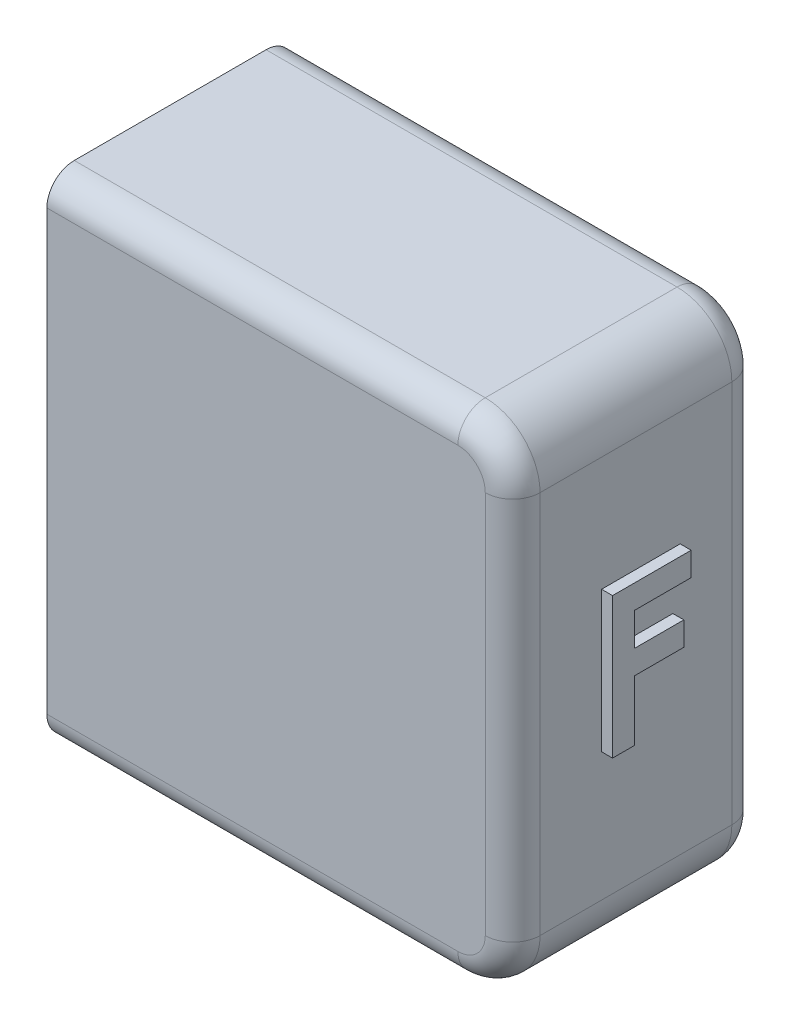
ISO-10303-21;
HEADER;
FILE_DESCRIPTION(('STEP AP214'),'2;1');
FILE_NAME('part.step','',(''),(''),'','','');
FILE_SCHEMA(('AUTOMOTIVE_DESIGN { 1 0 10303 214 1 1 1 1 }'));
ENDSEC;
DATA;
#1=APPLICATION_CONTEXT('core data for automotive mechanical design processes');
#2=APPLICATION_PROTOCOL_DEFINITION('international standard','automotive_design',2000,#1);
#3=PRODUCT_CONTEXT('',#1,'mechanical');
#4=PRODUCT('Part','Part','',(#3));
#5=PRODUCT_RELATED_PRODUCT_CATEGORY('part','',(#4));
#6=PRODUCT_DEFINITION_FORMATION('','',#4);
#7=PRODUCT_DEFINITION_CONTEXT('part definition',#1,'design');
#8=PRODUCT_DEFINITION('design','',#6,#7);
#9=PRODUCT_DEFINITION_SHAPE('','',#8);
#10=(LENGTH_UNIT() NAMED_UNIT(*) SI_UNIT(.MILLI.,.METRE.));
#11=(NAMED_UNIT(*) PLANE_ANGLE_UNIT() SI_UNIT($,.RADIAN.));
#12=(NAMED_UNIT(*) SI_UNIT($,.STERADIAN.) SOLID_ANGLE_UNIT());
#13=UNCERTAINTY_MEASURE_WITH_UNIT(LENGTH_MEASURE(1.E-05),#10,'distance_accuracy_value','');
#14=(GEOMETRIC_REPRESENTATION_CONTEXT(3) GLOBAL_UNCERTAINTY_ASSIGNED_CONTEXT((#13)) GLOBAL_UNIT_ASSIGNED_CONTEXT((#10,
#11,#12)) REPRESENTATION_CONTEXT('',''));
#15=CARTESIAN_POINT('',(0.,0.,0.));
#16=DIRECTION('',(0.,0.,1.));
#17=DIRECTION('',(1.,0.,0.));
#18=AXIS2_PLACEMENT_3D('',#15,#16,#17);
#19=CARTESIAN_POINT('',(5.5,-7.,7.));
#20=DIRECTION('',(1.,0.,0.));
#21=DIRECTION('',(0.,1.,0.));
#22=AXIS2_PLACEMENT_3D('',#19,#20,#21);
#23=PLANE('',#22);
#24=DIRECTION('',(0.,1.,0.));
#25=VECTOR('',#24,1.);
#26=CARTESIAN_POINT('',(5.49999999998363,6.19999999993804,3.5));
#27=LINE('',#26,#25);
#28=CARTESIAN_POINT('',(5.5,6.2,3.5));
#29=VERTEX_POINT('',#28);
#30=CARTESIAN_POINT('',(5.5,7.,3.5));
#31=VERTEX_POINT('',#30);
#32=EDGE_CURVE('E390',#29,#31,#27,.T.);
#33=ORIENTED_EDGE('',*,*,#32,.T.);
#34=DIRECTION('',(0.,0.,-1.));
#35=VECTOR('',#34,1.);
#36=CARTESIAN_POINT('',(5.5,7.,7.));
#37=LINE('',#36,#35);
#38=CARTESIAN_POINT('',(5.5,7.,2.));
#39=VERTEX_POINT('',#38);
#40=EDGE_CURVE('E484',#31,#39,#37,.T.);
#41=ORIENTED_EDGE('',*,*,#40,.T.);
#42=DIRECTION('',(0.,-1.,0.));
#43=VECTOR('',#42,1.);
#44=CARTESIAN_POINT('',(5.5,-7.,2.));
#45=LINE('',#44,#43);
#46=CARTESIAN_POINT('',(5.5,-7.,2.));
#47=VERTEX_POINT('',#46);
#48=EDGE_CURVE('E459',#39,#47,#45,.T.);
#49=ORIENTED_EDGE('',*,*,#48,.T.);
#50=DIRECTION('',(0.,0.,-1.));
#51=VECTOR('',#50,1.);
#52=CARTESIAN_POINT('',(5.5,-7.,7.));
#53=LINE('',#52,#51);
#54=CARTESIAN_POINT('',(5.49999999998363,-7.,3.5));
#55=VERTEX_POINT('',#54);
#56=EDGE_CURVE('E480',#55,#47,#53,.T.);
#57=ORIENTED_EDGE('',*,*,#56,.F.);
#58=DIRECTION('',(0.,1.,0.));
#59=VECTOR('',#58,1.);
#60=CARTESIAN_POINT('',(5.49999999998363,-6.20000000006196,3.5));
#61=LINE('',#60,#59);
#62=CARTESIAN_POINT('',(5.49999999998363,-6.2,3.5));
#63=VERTEX_POINT('',#62);
#64=EDGE_CURVE('E418',#55,#63,#61,.T.);
#65=ORIENTED_EDGE('',*,*,#64,.T.);
#66=DIRECTION('',(0.,0.,1.));
#67=VECTOR('',#66,1.);
#68=CARTESIAN_POINT('',(5.49999999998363,-6.2,3.5));
#69=LINE('',#68,#67);
#70=CARTESIAN_POINT('',(5.49999999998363,-6.2,5.5));
#71=VERTEX_POINT('',#70);
#72=EDGE_CURVE('E423',#63,#71,#69,.T.);
#73=ORIENTED_EDGE('',*,*,#72,.T.);
#74=DIRECTION('',(0.,-1.,0.));
#75=VECTOR('',#74,1.);
#76=CARTESIAN_POINT('',(5.49999999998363,-6.20000000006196,5.5));
#77=LINE('',#76,#75);
#78=CARTESIAN_POINT('',(5.49999999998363,-7.,5.5));
#79=VERTEX_POINT('',#78);
#80=EDGE_CURVE('E419',#71,#79,#77,.T.);
#81=ORIENTED_EDGE('',*,*,#80,.T.);
#82=CARTESIAN_POINT('',(5.5,-7.,7.));
#83=VERTEX_POINT('',#82);
#84=EDGE_CURVE('E481',#83,#79,#53,.T.);
#85=ORIENTED_EDGE('',*,*,#84,.F.);
#86=DIRECTION('',(0.,-1.,0.));
#87=VECTOR('',#86,1.);
#88=CARTESIAN_POINT('',(5.5,-7.,7.));
#89=LINE('',#88,#87);
#90=CARTESIAN_POINT('',(5.5,7.,7.));
#91=VERTEX_POINT('',#90);
#92=EDGE_CURVE('E438',#91,#83,#89,.T.);
#93=ORIENTED_EDGE('',*,*,#92,.F.);
#94=CARTESIAN_POINT('',(5.5,7.,5.5));
#95=VERTEX_POINT('',#94);
#96=EDGE_CURVE('E485',#91,#95,#37,.T.);
#97=ORIENTED_EDGE('',*,*,#96,.T.);
#98=DIRECTION('',(0.,-1.,0.));
#99=VECTOR('',#98,1.);
#100=CARTESIAN_POINT('',(5.49999999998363,6.19999999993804,5.5));
#101=LINE('',#100,#99);
#102=CARTESIAN_POINT('',(5.5,6.2,5.5));
#103=VERTEX_POINT('',#102);
#104=EDGE_CURVE('E402',#95,#103,#101,.T.);
#105=ORIENTED_EDGE('',*,*,#104,.T.);
#106=DIRECTION('',(0.,0.,-1.));
#107=VECTOR('',#106,1.);
#108=CARTESIAN_POINT('',(5.49999999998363,6.2,3.5));
#109=LINE('',#108,#107);
#110=EDGE_CURVE('E399',#103,#29,#109,.T.);
#111=ORIENTED_EDGE('',*,*,#110,.T.);
#112=EDGE_LOOP('',(#33,#41,#49,#57,#65,#73,#81,#85,#93,#97,#105,#111));
#113=FACE_BOUND('',#112,.T.);
#114=ADVANCED_FACE('F37',(#113),#23,.F.);
#115=CARTESIAN_POINT('',(-5.5,7.,7.));
#116=DIRECTION('',(-1.,0.,0.));
#117=DIRECTION('',(0.,0.,1.));
#118=AXIS2_PLACEMENT_3D('',#115,#116,#117);
#119=PLANE('',#118);
#120=DIRECTION('',(0.,1.,0.));
#121=VECTOR('',#120,1.);
#122=CARTESIAN_POINT('',(-5.5,6.2,3.5));
#123=LINE('',#122,#121);
#124=CARTESIAN_POINT('',(-5.5,6.2,3.5));
#125=VERTEX_POINT('',#124);
#126=CARTESIAN_POINT('',(-5.5,7.,3.5));
#127=VERTEX_POINT('',#126);
#128=EDGE_CURVE('E377',#125,#127,#123,.T.);
#129=ORIENTED_EDGE('',*,*,#128,.F.);
#130=DIRECTION('',(0.,0.,-1.));
#131=VECTOR('',#130,1.);
#132=CARTESIAN_POINT('',(-5.5,6.2,7.));
#133=LINE('',#132,#131);
#134=CARTESIAN_POINT('',(-5.5,6.2,2.));
#135=VERTEX_POINT('',#134);
#136=EDGE_CURVE('E491',#125,#135,#133,.T.);
#137=ORIENTED_EDGE('',*,*,#136,.T.);
#138=DIRECTION('',(0.,1.,0.));
#139=VECTOR('',#138,1.);
#140=CARTESIAN_POINT('',(-5.5,7.,2.));
#141=LINE('',#140,#139);
#142=CARTESIAN_POINT('',(-5.5,7.,2.));
#143=VERTEX_POINT('',#142);
#144=EDGE_CURVE('E453',#135,#143,#141,.T.);
#145=ORIENTED_EDGE('',*,*,#144,.T.);
#146=DIRECTION('',(0.,0.,-1.));
#147=VECTOR('',#146,1.);
#148=CARTESIAN_POINT('',(-5.5,7.,7.));
#149=LINE('',#148,#147);
#150=EDGE_CURVE('E488',#127,#143,#149,.T.);
#151=ORIENTED_EDGE('',*,*,#150,.F.);
#152=EDGE_LOOP('',(#129,#137,#145,#151));
#153=FACE_BOUND('',#152,.T.);
#154=ADVANCED_FACE('F667',(#153),#119,.F.);
#155=DIRECTION('',(0.,-1.,0.));
#156=VECTOR('',#155,1.);
#157=CARTESIAN_POINT('',(-5.5,6.2,5.5));
#158=LINE('',#157,#156);
#159=CARTESIAN_POINT('',(-5.5,7.,5.5));
#160=VERTEX_POINT('',#159);
#161=CARTESIAN_POINT('',(-5.5,6.2,5.5));
#162=VERTEX_POINT('',#161);
#163=EDGE_CURVE('E384',#160,#162,#158,.T.);
#164=ORIENTED_EDGE('',*,*,#163,.F.);
#165=CARTESIAN_POINT('',(-5.5,7.,7.));
#166=VERTEX_POINT('',#165);
#167=EDGE_CURVE('E489',#166,#160,#149,.T.);
#168=ORIENTED_EDGE('',*,*,#167,.F.);
#169=DIRECTION('',(0.,1.,0.));
#170=VECTOR('',#169,1.);
#171=CARTESIAN_POINT('',(-5.5,7.,7.));
#172=LINE('',#171,#170);
#173=CARTESIAN_POINT('',(-5.5,6.2,7.));
#174=VERTEX_POINT('',#173);
#175=EDGE_CURVE('E431',#174,#166,#172,.T.);
#176=ORIENTED_EDGE('',*,*,#175,.F.);
#177=EDGE_CURVE('E492',#174,#162,#133,.T.);
#178=ORIENTED_EDGE('',*,*,#177,.T.);
#179=EDGE_LOOP('',(#164,#168,#176,#178));
#180=FACE_BOUND('',#179,.T.);
#181=ADVANCED_FACE('F673',(#180),#119,.F.);
#182=CARTESIAN_POINT('',(5.5,7.,7.));
#183=DIRECTION('',(0.,1.,0.));
#184=DIRECTION('',(-1.,0.,0.));
#185=AXIS2_PLACEMENT_3D('',#182,#183,#184);
#186=PLANE('',#185);
#187=DIRECTION('',(-1.,0.,0.));
#188=VECTOR('',#187,1.);
#189=CARTESIAN_POINT('',(500000.,7.,3.5));
#190=LINE('',#189,#188);
#191=EDGE_CURVE('E388',#31,#127,#190,.T.);
#192=ORIENTED_EDGE('',*,*,#191,.T.);
#193=ORIENTED_EDGE('',*,*,#150,.T.);
#194=DIRECTION('',(1.,0.,0.));
#195=VECTOR('',#194,1.);
#196=CARTESIAN_POINT('',(5.5,7.,2.));
#197=LINE('',#196,#195);
#198=EDGE_CURVE('E456',#143,#39,#197,.T.);
#199=ORIENTED_EDGE('',*,*,#198,.T.);
#200=ORIENTED_EDGE('',*,*,#40,.F.);
#201=EDGE_LOOP('',(#192,#193,#199,#200));
#202=FACE_BOUND('',#201,.T.);
#203=ADVANCED_FACE('F680',(#202),#186,.F.);
#204=DIRECTION('',(-1.,0.,0.));
#205=VECTOR('',#204,1.);
#206=CARTESIAN_POINT('',(500000.,7.,5.5));
#207=LINE('',#206,#205);
#208=EDGE_CURVE('E391',#95,#160,#207,.T.);
#209=ORIENTED_EDGE('',*,*,#208,.F.);
#210=ORIENTED_EDGE('',*,*,#96,.F.);
#211=DIRECTION('',(1.,0.,0.));
#212=VECTOR('',#211,1.);
#213=CARTESIAN_POINT('',(5.5,7.,7.));
#214=LINE('',#213,#212);
#215=EDGE_CURVE('E435',#166,#91,#214,.T.);
#216=ORIENTED_EDGE('',*,*,#215,.F.);
#217=ORIENTED_EDGE('',*,*,#167,.T.);
#218=EDGE_LOOP('',(#209,#210,#216,#217));
#219=FACE_BOUND('',#218,.T.);
#220=ADVANCED_FACE('F682',(#219),#186,.F.);
#221=CARTESIAN_POINT('',(-5.5,-7.,7.));
#222=DIRECTION('',(0.,-1.,0.));
#223=DIRECTION('',(1.,0.,0.));
#224=AXIS2_PLACEMENT_3D('',#221,#222,#223);
#225=PLANE('',#224);
#226=DIRECTION('',(-1.,0.,0.));
#227=VECTOR('',#226,1.);
#228=CARTESIAN_POINT('',(500000.,-7.,5.5));
#229=LINE('',#228,#227);
#230=CARTESIAN_POINT('',(-5.5,-7.,5.5));
#231=VERTEX_POINT('',#230);
#232=EDGE_CURVE('E410',#79,#231,#229,.T.);
#233=ORIENTED_EDGE('',*,*,#232,.T.);
#234=DIRECTION('',(0.,0.,-1.));
#235=VECTOR('',#234,1.);
#236=CARTESIAN_POINT('',(-5.5,-7.,7.));
#237=LINE('',#236,#235);
#238=CARTESIAN_POINT('',(-5.5,-7.,7.));
#239=VERTEX_POINT('',#238);
#240=EDGE_CURVE('E477',#239,#231,#237,.T.);
#241=ORIENTED_EDGE('',*,*,#240,.F.);
#242=DIRECTION('',(-1.,0.,0.));
#243=VECTOR('',#242,1.);
#244=CARTESIAN_POINT('',(-5.5,-7.,7.));
#245=LINE('',#244,#243);
#246=EDGE_CURVE('E441',#83,#239,#245,.T.);
#247=ORIENTED_EDGE('',*,*,#246,.F.);
#248=ORIENTED_EDGE('',*,*,#84,.T.);
#249=EDGE_LOOP('',(#233,#241,#247,#248));
#250=FACE_BOUND('',#249,.T.);
#251=ADVANCED_FACE('F678',(#250),#225,.F.);
#252=DIRECTION('',(-1.,0.,0.));
#253=VECTOR('',#252,1.);
#254=CARTESIAN_POINT('',(500000.,-7.,3.5));
#255=LINE('',#254,#253);
#256=CARTESIAN_POINT('',(-5.5,-7.,3.5));
#257=VERTEX_POINT('',#256);
#258=EDGE_CURVE('E407',#55,#257,#255,.T.);
#259=ORIENTED_EDGE('',*,*,#258,.F.);
#260=ORIENTED_EDGE('',*,*,#56,.T.);
#261=DIRECTION('',(-1.,0.,0.));
#262=VECTOR('',#261,1.);
#263=CARTESIAN_POINT('',(-5.5,-7.,2.));
#264=LINE('',#263,#262);
#265=CARTESIAN_POINT('',(-5.5,-7.,2.));
#266=VERTEX_POINT('',#265);
#267=EDGE_CURVE('E462',#47,#266,#264,.T.);
#268=ORIENTED_EDGE('',*,*,#267,.T.);
#269=EDGE_CURVE('E476',#257,#266,#237,.T.);
#270=ORIENTED_EDGE('',*,*,#269,.F.);
#271=EDGE_LOOP('',(#259,#260,#268,#270));
#272=FACE_BOUND('',#271,.T.);
#273=ADVANCED_FACE('F707',(#272),#225,.F.);
#274=CARTESIAN_POINT('',(-5.5,-6.2,7.));
#275=DIRECTION('',(-1.,0.,0.));
#276=DIRECTION('',(0.,0.,1.));
#277=AXIS2_PLACEMENT_3D('',#274,#275,#276);
#278=PLANE('',#277);
#279=DIRECTION('',(0.,-1.,0.));
#280=VECTOR('',#279,1.);
#281=CARTESIAN_POINT('',(-5.5,-6.2,5.5));
#282=LINE('',#281,#280);
#283=CARTESIAN_POINT('',(-5.5,-6.2,5.5));
#284=VERTEX_POINT('',#283);
#285=EDGE_CURVE('E405',#284,#231,#282,.T.);
#286=ORIENTED_EDGE('',*,*,#285,.F.);
#287=DIRECTION('',(0.,0.,-1.));
#288=VECTOR('',#287,1.);
#289=CARTESIAN_POINT('',(-5.5,-6.2,7.));
#290=LINE('',#289,#288);
#291=CARTESIAN_POINT('',(-5.5,-6.2,7.));
#292=VERTEX_POINT('',#291);
#293=EDGE_CURVE('E473',#292,#284,#290,.T.);
#294=ORIENTED_EDGE('',*,*,#293,.F.);
#295=DIRECTION('',(0.,1.,0.));
#296=VECTOR('',#295,1.);
#297=CARTESIAN_POINT('',(-5.5,-6.2,7.));
#298=LINE('',#297,#296);
#299=EDGE_CURVE('E444',#239,#292,#298,.T.);
#300=ORIENTED_EDGE('',*,*,#299,.F.);
#301=ORIENTED_EDGE('',*,*,#240,.T.);
#302=EDGE_LOOP('',(#286,#294,#300,#301));
#303=FACE_BOUND('',#302,.T.);
#304=ADVANCED_FACE('F695',(#303),#278,.F.);
#305=DIRECTION('',(0.,1.,0.));
#306=VECTOR('',#305,1.);
#307=CARTESIAN_POINT('',(-5.5,-6.2,3.5));
#308=LINE('',#307,#306);
#309=CARTESIAN_POINT('',(-5.5,-6.2,3.5));
#310=VERTEX_POINT('',#309);
#311=EDGE_CURVE('E401',#257,#310,#308,.T.);
#312=ORIENTED_EDGE('',*,*,#311,.F.);
#313=ORIENTED_EDGE('',*,*,#269,.T.);
#314=DIRECTION('',(0.,1.,0.));
#315=VECTOR('',#314,1.);
#316=CARTESIAN_POINT('',(-5.5,-6.2,2.));
#317=LINE('',#316,#315);
#318=CARTESIAN_POINT('',(-5.5,-6.2,2.));
#319=VERTEX_POINT('',#318);
#320=EDGE_CURVE('E465',#266,#319,#317,.T.);
#321=ORIENTED_EDGE('',*,*,#320,.T.);
#322=EDGE_CURVE('E472',#310,#319,#290,.T.);
#323=ORIENTED_EDGE('',*,*,#322,.F.);
#324=EDGE_LOOP('',(#312,#313,#321,#323));
#325=FACE_BOUND('',#324,.T.);
#326=ADVANCED_FACE('F686',(#325),#278,.F.);
#327=CARTESIAN_POINT('',(0.,0.,2.));
#328=DIRECTION('',(0.,0.,-1.));
#329=DIRECTION('',(-1.,0.,0.));
#330=AXIS2_PLACEMENT_3D('',#327,#328,#329);
#331=PLANE('',#330);
#332=DIRECTION('',(-1.,0.,0.));
#333=VECTOR('',#332,1.);
#334=CARTESIAN_POINT('',(-5.5,-6.2,2.));
#335=LINE('',#334,#333);
#336=CARTESIAN_POINT('',(-8.5,-6.2,2.));
#337=VERTEX_POINT('',#336);
#338=EDGE_CURVE('E432',#319,#337,#335,.T.);
#339=ORIENTED_EDGE('',*,*,#338,.F.);
#340=ORIENTED_EDGE('',*,*,#320,.F.);
#341=ORIENTED_EDGE('',*,*,#267,.F.);
#342=ORIENTED_EDGE('',*,*,#48,.F.);
#343=ORIENTED_EDGE('',*,*,#198,.F.);
#344=ORIENTED_EDGE('',*,*,#144,.F.);
#345=DIRECTION('',(1.,0.,0.));
#346=VECTOR('',#345,1.);
#347=CARTESIAN_POINT('',(-5.5,6.2,2.));
#348=LINE('',#347,#346);
#349=CARTESIAN_POINT('',(-8.5,6.2,2.));
#350=VERTEX_POINT('',#349);
#351=EDGE_CURVE('E422',#350,#135,#348,.T.);
#352=ORIENTED_EDGE('',*,*,#351,.F.);
#353=DIRECTION('',(0.,-1.,0.));
#354=VECTOR('',#353,1.);
#355=CARTESIAN_POINT('',(-8.5,-9.,2.));
#356=LINE('',#355,#354);
#357=EDGE_CURVE('E498',#350,#337,#356,.T.);
#358=ORIENTED_EDGE('',*,*,#357,.T.);
#359=EDGE_LOOP('',(#339,#340,#341,#342,#343,#344,#352,#358));
#360=FACE_BOUND('',#359,.T.);
#361=ADVANCED_FACE('F684',(#360),#331,.F.);
#362=CARTESIAN_POINT('',(8.5,-9.,2.));
#363=DIRECTION('',(-1.,0.,0.));
#364=DIRECTION('',(0.,0.,1.));
#365=AXIS2_PLACEMENT_3D('',#362,#363,#364);
#366=PLANE('',#365);
#367=DIRECTION('',(0.,-1.,0.));
#368=VECTOR('',#367,1.);
#369=CARTESIAN_POINT('',(8.5,-0.111573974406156,4.95365833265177));
#370=LINE('',#369,#368);
#371=CARTESIAN_POINT('',(8.5,-0.111573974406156,4.95365833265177));
#372=VERTEX_POINT('',#371);
#373=CARTESIAN_POINT('',(8.5,-2.31298999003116,4.95365833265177));
#374=VERTEX_POINT('',#373);
#375=EDGE_CURVE('E311',#372,#374,#370,.T.);
#376=ORIENTED_EDGE('',*,*,#375,.T.);
#377=DIRECTION('',(0.,0.,1.));
#378=VECTOR('',#377,1.);
#379=CARTESIAN_POINT('',(8.5,-2.31298999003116,4.95365833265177));
#380=LINE('',#379,#378);
#381=CARTESIAN_POINT('',(8.5,-2.31298999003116,5.7541732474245));
#382=VERTEX_POINT('',#381);
#383=EDGE_CURVE('E337',#374,#382,#380,.T.);
#384=ORIENTED_EDGE('',*,*,#383,.T.);
#385=DIRECTION('',(0.,1.,0.));
#386=VECTOR('',#385,1.);
#387=CARTESIAN_POINT('',(8.5,-2.31298999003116,5.7541732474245));
#388=LINE('',#387,#386);
#389=CARTESIAN_POINT('',(8.5,2.82364737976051,5.7541732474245));
#390=VERTEX_POINT('',#389);
#391=EDGE_CURVE('E290',#382,#390,#388,.T.);
#392=ORIENTED_EDGE('',*,*,#391,.T.);
#393=DIRECTION('',(0.,0.,-1.));
#394=VECTOR('',#393,1.);
#395=CARTESIAN_POINT('',(8.5,2.82364737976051,5.7541732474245));
#396=LINE('',#395,#394);
#397=CARTESIAN_POINT('',(8.5,2.82364737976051,2.8856614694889));
#398=VERTEX_POINT('',#397);
#399=EDGE_CURVE('E54',#390,#398,#396,.T.);
#400=ORIENTED_EDGE('',*,*,#399,.T.);
#401=DIRECTION('',(0.,-1.,0.));
#402=VECTOR('',#401,1.);
#403=CARTESIAN_POINT('',(8.5,2.82364737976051,2.8856614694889));
#404=LINE('',#403,#402);
#405=CARTESIAN_POINT('',(8.5,1.95642288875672,2.8856614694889));
#406=VERTEX_POINT('',#405);
#407=EDGE_CURVE('E341',#398,#406,#404,.T.);
#408=ORIENTED_EDGE('',*,*,#407,.T.);
#409=DIRECTION('',(0.,0.,1.));
#410=VECTOR('',#409,1.);
#411=CARTESIAN_POINT('',(8.5,1.95642288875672,2.8856614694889));
#412=LINE('',#411,#410);
#413=CARTESIAN_POINT('',(8.5,1.95642288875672,4.95365833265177));
#414=VERTEX_POINT('',#413);
#415=EDGE_CURVE('E344',#406,#414,#412,.T.);
#416=ORIENTED_EDGE('',*,*,#415,.T.);
#417=DIRECTION('',(0.,-1.,0.));
#418=VECTOR('',#417,1.);
#419=CARTESIAN_POINT('',(8.5,1.95642288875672,4.95365833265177));
#420=LINE('',#419,#418);
#421=CARTESIAN_POINT('',(8.5,0.755650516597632,4.95365833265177));
#422=VERTEX_POINT('',#421);
#423=EDGE_CURVE('E347',#414,#422,#420,.T.);
#424=ORIENTED_EDGE('',*,*,#423,.T.);
#425=DIRECTION('',(0.,0.,-1.));
#426=VECTOR('',#425,1.);
#427=CARTESIAN_POINT('',(8.5,0.755650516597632,4.95365833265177));
#428=LINE('',#427,#426);
#429=CARTESIAN_POINT('',(8.5,0.755650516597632,3.15249977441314));
#430=VERTEX_POINT('',#429);
#431=EDGE_CURVE('E350',#422,#430,#428,.T.);
#432=ORIENTED_EDGE('',*,*,#431,.T.);
#433=DIRECTION('',(0.,-1.,0.));
#434=VECTOR('',#433,1.);
#435=CARTESIAN_POINT('',(8.5,0.755650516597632,3.15249977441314));
#436=LINE('',#435,#434);
#437=CARTESIAN_POINT('',(8.5,-0.111573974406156,3.15249977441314));
#438=VERTEX_POINT('',#437);
#439=EDGE_CURVE('E353',#430,#438,#436,.T.);
#440=ORIENTED_EDGE('',*,*,#439,.T.);
#441=DIRECTION('',(0.,0.,1.));
#442=VECTOR('',#441,1.);
#443=CARTESIAN_POINT('',(8.5,-0.111573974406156,3.15249977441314));
#444=LINE('',#443,#442);
#445=EDGE_CURVE('E314',#438,#372,#444,.T.);
#446=ORIENTED_EDGE('',*,*,#445,.T.);
#447=EDGE_LOOP('',(#376,#384,#392,#400,#408,#416,#424,#432,#440,#446));
#448=FACE_BOUND('',#447,.T.);
#449=DIRECTION('',(0.,0.,-1.));
#450=VECTOR('',#449,1.);
#451=CARTESIAN_POINT('',(8.5,-7.,2.));
#452=LINE('',#451,#450);
#453=CARTESIAN_POINT('',(8.5,-7.,8.));
#454=VERTEX_POINT('',#453);
#455=CARTESIAN_POINT('',(8.5,-7.,1.));
#456=VERTEX_POINT('',#455);
#457=EDGE_CURVE('E511',#454,#456,#452,.T.);
#458=ORIENTED_EDGE('',*,*,#457,.T.);
#459=DIRECTION('',(0.,1.,0.));
#460=VECTOR('',#459,1.);
#461=CARTESIAN_POINT('',(8.5,7.,1.));
#462=LINE('',#461,#460);
#463=CARTESIAN_POINT('',(8.5,7.,1.));
#464=VERTEX_POINT('',#463);
#465=EDGE_CURVE('E11',#456,#464,#462,.T.);
#466=ORIENTED_EDGE('',*,*,#465,.T.);
#467=DIRECTION('',(0.,0.,-1.));
#468=VECTOR('',#467,1.);
#469=CARTESIAN_POINT('',(8.5,7.,2.));
#470=LINE('',#469,#468);
#471=CARTESIAN_POINT('',(8.5,7.,8.));
#472=VERTEX_POINT('',#471);
#473=EDGE_CURVE('E508',#464,#472,#470,.F.);
#474=ORIENTED_EDGE('',*,*,#473,.T.);
#475=DIRECTION('',(0.,1.,0.));
#476=VECTOR('',#475,1.);
#477=CARTESIAN_POINT('',(8.5,-7.,8.));
#478=LINE('',#477,#476);
#479=EDGE_CURVE('E46',#472,#454,#478,.F.);
#480=ORIENTED_EDGE('',*,*,#479,.T.);
#481=EDGE_LOOP('',(#458,#466,#474,#480));
#482=FACE_BOUND('',#481,.T.);
#483=ADVANCED_FACE('F630',(#448,#482),#366,.F.);
#484=CARTESIAN_POINT('',(-8.5,9.,2.));
#485=DIRECTION('',(0.,-1.,0.));
#486=DIRECTION('',(0.,0.,-1.));
#487=AXIS2_PLACEMENT_3D('',#484,#485,#486);
#488=PLANE('',#487);
#489=DIRECTION('',(0.,0.,-1.));
#490=VECTOR('',#489,1.);
#491=CARTESIAN_POINT('',(6.5,9.,2.));
#492=LINE('',#491,#490);
#493=CARTESIAN_POINT('',(6.5,9.,8.));
#494=VERTEX_POINT('',#493);
#495=CARTESIAN_POINT('',(6.5,9.,1.));
#496=VERTEX_POINT('',#495);
#497=EDGE_CURVE('E517',#494,#496,#492,.T.);
#498=ORIENTED_EDGE('',*,*,#497,.T.);
#499=DIRECTION('',(-1.,0.,0.));
#500=VECTOR('',#499,1.);
#501=CARTESIAN_POINT('',(-8.5,9.,1.));
#502=LINE('',#501,#500);
#503=CARTESIAN_POINT('',(-8.5,9.,1.));
#504=VERTEX_POINT('',#503);
#505=EDGE_CURVE('E549',#496,#504,#502,.T.);
#506=ORIENTED_EDGE('',*,*,#505,.T.);
#507=DIRECTION('',(0.,0.,-1.));
#508=VECTOR('',#507,1.);
#509=CARTESIAN_POINT('',(-8.5,9.,2.));
#510=LINE('',#509,#508);
#511=CARTESIAN_POINT('',(-8.5,9.,8.));
#512=VERTEX_POINT('',#511);
#513=EDGE_CURVE('E505',#512,#504,#510,.T.);
#514=ORIENTED_EDGE('',*,*,#513,.F.);
#515=DIRECTION('',(-1.,0.,0.));
#516=VECTOR('',#515,1.);
#517=CARTESIAN_POINT('',(6.5,9.,8.));
#518=LINE('',#517,#516);
#519=EDGE_CURVE('E547',#512,#494,#518,.F.);
#520=ORIENTED_EDGE('',*,*,#519,.T.);
#521=EDGE_LOOP('',(#498,#506,#514,#520));
#522=FACE_BOUND('',#521,.T.);
#523=ADVANCED_FACE('F646',(#522),#488,.F.);
#524=CARTESIAN_POINT('',(-8.5,-9.,2.));
#525=DIRECTION('',(1.,0.,0.));
#526=DIRECTION('',(0.,0.,-1.));
#527=AXIS2_PLACEMENT_3D('',#524,#525,#526);
#528=PLANE('',#527);
#529=DIRECTION('',(0.,-1.,0.));
#530=VECTOR('',#529,1.);
#531=CARTESIAN_POINT('',(-8.5,-9.,0.));
#532=LINE('',#531,#530);
#533=CARTESIAN_POINT('',(-8.5,8.,0.));
#534=VERTEX_POINT('',#533);
#535=CARTESIAN_POINT('',(-8.5,-8.,0.));
#536=VERTEX_POINT('',#535);
#537=EDGE_CURVE('E497',#534,#536,#532,.T.);
#538=ORIENTED_EDGE('',*,*,#537,.T.);
#539=CARTESIAN_POINT('',(-8.5,-8.,1.));
#540=DIRECTION('',(1.,0.,0.));
#541=DIRECTION('',(0.,0.,-1.));
#542=AXIS2_PLACEMENT_3D('',#539,#540,#541);
#543=CIRCLE('',#542,1.);
#544=CARTESIAN_POINT('',(-8.5,-9.,1.));
#545=VERTEX_POINT('',#544);
#546=EDGE_CURVE('E541',#536,#545,#543,.F.);
#547=ORIENTED_EDGE('',*,*,#546,.T.);
#548=DIRECTION('',(0.,0.,-1.));
#549=VECTOR('',#548,1.);
#550=CARTESIAN_POINT('',(-8.5,-9.,2.));
#551=LINE('',#550,#549);
#552=CARTESIAN_POINT('',(-8.5,-9.,8.));
#553=VERTEX_POINT('',#552);
#554=EDGE_CURVE('E500',#553,#545,#551,.T.);
#555=ORIENTED_EDGE('',*,*,#554,.F.);
#556=CARTESIAN_POINT('',(-8.5,-8.,8.));
#557=DIRECTION('',(1.,0.,0.));
#558=DIRECTION('',(0.,0.,-1.));
#559=AXIS2_PLACEMENT_3D('',#556,#557,#558);
#560=CIRCLE('',#559,1.);
#561=CARTESIAN_POINT('',(-8.49999999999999,-8.,9.));
#562=VERTEX_POINT('',#561);
#563=EDGE_CURVE('E537',#553,#562,#560,.F.);
#564=ORIENTED_EDGE('',*,*,#563,.T.);
#565=DIRECTION('',(0.,-1.,0.));
#566=VECTOR('',#565,1.);
#567=CARTESIAN_POINT('',(-8.5,9.,9.));
#568=LINE('',#567,#566);
#569=CARTESIAN_POINT('',(-8.5,8.,9.));
#570=VERTEX_POINT('',#569);
#571=EDGE_CURVE('E374',#570,#562,#568,.T.);
#572=ORIENTED_EDGE('',*,*,#571,.F.);
#573=CARTESIAN_POINT('',(-8.5,8.,8.));
#574=DIRECTION('',(1.,0.,0.));
#575=DIRECTION('',(0.,0.,-1.));
#576=AXIS2_PLACEMENT_3D('',#573,#574,#575);
#577=CIRCLE('',#576,1.);
#578=EDGE_CURVE('E535',#570,#512,#577,.F.);
#579=ORIENTED_EDGE('',*,*,#578,.T.);
#580=ORIENTED_EDGE('',*,*,#513,.T.);
#581=CARTESIAN_POINT('',(-8.5,8.,1.));
#582=DIRECTION('',(1.,0.,0.));
#583=DIRECTION('',(0.,0.,-1.));
#584=AXIS2_PLACEMENT_3D('',#581,#582,#583);
#585=CIRCLE('',#584,1.);
#586=EDGE_CURVE('E539',#504,#534,#585,.F.);
#587=ORIENTED_EDGE('',*,*,#586,.T.);
#588=EDGE_LOOP('',(#538,#547,#555,#564,#572,#579,#580,#587));
#589=FACE_BOUND('',#588,.T.);
#590=DIRECTION('',(0.,-1.,0.));
#591=VECTOR('',#590,1.);
#592=CARTESIAN_POINT('',(-8.5,9.,7.));
#593=LINE('',#592,#591);
#594=CARTESIAN_POINT('',(-8.5,6.2,7.));
#595=VERTEX_POINT('',#594);
#596=CARTESIAN_POINT('',(-8.49999999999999,-6.2,7.));
#597=VERTEX_POINT('',#596);
#598=EDGE_CURVE('E378',#595,#597,#593,.T.);
#599=ORIENTED_EDGE('',*,*,#598,.T.);
#600=DIRECTION('',(0.,0.,-1.));
#601=VECTOR('',#600,1.);
#602=CARTESIAN_POINT('',(-8.5,-6.2,7.));
#603=LINE('',#602,#601);
#604=EDGE_CURVE('E450',#597,#337,#603,.T.);
#605=ORIENTED_EDGE('',*,*,#604,.T.);
#606=ORIENTED_EDGE('',*,*,#357,.F.);
#607=DIRECTION('',(0.,0.,-1.));
#608=VECTOR('',#607,1.);
#609=CARTESIAN_POINT('',(-8.5,6.2,7.));
#610=LINE('',#609,#608);
#611=EDGE_CURVE('E494',#595,#350,#610,.T.);
#612=ORIENTED_EDGE('',*,*,#611,.F.);
#613=EDGE_LOOP('',(#599,#605,#606,#612));
#614=FACE_BOUND('',#613,.T.);
#615=ADVANCED_FACE('F600',(#589,#614),#528,.F.);
#616=CARTESIAN_POINT('',(-8.5,-9.,2.));
#617=DIRECTION('',(0.,1.,0.));
#618=DIRECTION('',(0.,0.,1.));
#619=AXIS2_PLACEMENT_3D('',#616,#617,#618);
#620=PLANE('',#619);
#621=ORIENTED_EDGE('',*,*,#554,.T.);
#622=DIRECTION('',(1.,0.,0.));
#623=VECTOR('',#622,1.);
#624=CARTESIAN_POINT('',(6.5,-9.,1.));
#625=LINE('',#624,#623);
#626=CARTESIAN_POINT('',(6.5,-9.,1.));
#627=VERTEX_POINT('',#626);
#628=EDGE_CURVE('E522',#545,#627,#625,.T.);
#629=ORIENTED_EDGE('',*,*,#628,.T.);
#630=DIRECTION('',(0.,0.,-1.));
#631=VECTOR('',#630,1.);
#632=CARTESIAN_POINT('',(6.5,-9.,2.));
#633=LINE('',#632,#631);
#634=CARTESIAN_POINT('',(6.5,-9.,8.));
#635=VERTEX_POINT('',#634);
#636=EDGE_CURVE('E514',#627,#635,#633,.F.);
#637=ORIENTED_EDGE('',*,*,#636,.T.);
#638=DIRECTION('',(1.,0.,0.));
#639=VECTOR('',#638,1.);
#640=CARTESIAN_POINT('',(-8.49999999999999,-9.,8.));
#641=LINE('',#640,#639);
#642=EDGE_CURVE('E520',#635,#553,#641,.F.);
#643=ORIENTED_EDGE('',*,*,#642,.T.);
#644=EDGE_LOOP('',(#621,#629,#637,#643));
#645=FACE_BOUND('',#644,.T.);
#646=ADVANCED_FACE('F616',(#645),#620,.F.);
#647=CARTESIAN_POINT('',(0.,0.,0.));
#648=DIRECTION('',(0.,0.,-1.));
#649=DIRECTION('',(-1.,0.,0.));
#650=AXIS2_PLACEMENT_3D('',#647,#648,#649);
#651=PLANE('',#650);
#652=CARTESIAN_POINT('',(6.5,-7.,0.));
#653=DIRECTION('',(0.,0.,-1.));
#654=DIRECTION('',(-1.,0.,0.));
#655=AXIS2_PLACEMENT_3D('',#652,#653,#654);
#656=CIRCLE('',#655,1.);
#657=CARTESIAN_POINT('',(7.5,-7.,0.));
#658=VERTEX_POINT('',#657);
#659=CARTESIAN_POINT('',(6.5,-8.,0.));
#660=VERTEX_POINT('',#659);
#661=EDGE_CURVE('E531',#658,#660,#656,.T.);
#662=ORIENTED_EDGE('',*,*,#661,.T.);
#663=DIRECTION('',(1.,0.,0.));
#664=VECTOR('',#663,1.);
#665=CARTESIAN_POINT('',(-8.5,-8.,0.));
#666=LINE('',#665,#664);
#667=EDGE_CURVE('E533',#660,#536,#666,.F.);
#668=ORIENTED_EDGE('',*,*,#667,.T.);
#669=ORIENTED_EDGE('',*,*,#537,.F.);
#670=DIRECTION('',(-1.,0.,0.));
#671=VECTOR('',#670,1.);
#672=CARTESIAN_POINT('',(6.5,8.,0.));
#673=LINE('',#672,#671);
#674=CARTESIAN_POINT('',(6.5,8.,0.));
#675=VERTEX_POINT('',#674);
#676=EDGE_CURVE('E529',#534,#675,#673,.F.);
#677=ORIENTED_EDGE('',*,*,#676,.T.);
#678=CARTESIAN_POINT('',(6.5,7.,0.));
#679=DIRECTION('',(0.,0.,-1.));
#680=DIRECTION('',(-1.,0.,0.));
#681=AXIS2_PLACEMENT_3D('',#678,#679,#680);
#682=CIRCLE('',#681,1.);
#683=CARTESIAN_POINT('',(7.5,7.,0.));
#684=VERTEX_POINT('',#683);
#685=EDGE_CURVE('E527',#675,#684,#682,.T.);
#686=ORIENTED_EDGE('',*,*,#685,.T.);
#687=DIRECTION('',(0.,1.,0.));
#688=VECTOR('',#687,1.);
#689=CARTESIAN_POINT('',(7.5,-7.,0.));
#690=LINE('',#689,#688);
#691=EDGE_CURVE('E525',#684,#658,#690,.F.);
#692=ORIENTED_EDGE('',*,*,#691,.T.);
#693=EDGE_LOOP('',(#662,#668,#669,#677,#686,#692));
#694=FACE_BOUND('',#693,.T.);
#695=ADVANCED_FACE('F653',(#694),#651,.T.);
#696=CARTESIAN_POINT('',(-5.5,6.2,7.));
#697=DIRECTION('',(0.,1.,0.));
#698=DIRECTION('',(-1.,0.,0.));
#699=AXIS2_PLACEMENT_3D('',#696,#697,#698);
#700=PLANE('',#699);
#701=ORIENTED_EDGE('',*,*,#351,.T.);
#702=ORIENTED_EDGE('',*,*,#136,.F.);
#703=DIRECTION('',(-1.,0.,0.));
#704=VECTOR('',#703,1.);
#705=CARTESIAN_POINT('',(500000.,6.2,3.5));
#706=LINE('',#705,#704);
#707=EDGE_CURVE('E387',#29,#125,#706,.T.);
#708=ORIENTED_EDGE('',*,*,#707,.F.);
#709=ORIENTED_EDGE('',*,*,#110,.F.);
#710=DIRECTION('',(-1.,0.,0.));
#711=VECTOR('',#710,1.);
#712=CARTESIAN_POINT('',(500000.,6.2,5.5));
#713=LINE('',#712,#711);
#714=EDGE_CURVE('E394',#103,#162,#713,.T.);
#715=ORIENTED_EDGE('',*,*,#714,.T.);
#716=ORIENTED_EDGE('',*,*,#177,.F.);
#717=DIRECTION('',(1.,0.,0.));
#718=VECTOR('',#717,1.);
#719=CARTESIAN_POINT('',(-5.5,6.2,7.));
#720=LINE('',#719,#718);
#721=EDGE_CURVE('E428',#595,#174,#720,.T.);
#722=ORIENTED_EDGE('',*,*,#721,.F.);
#723=ORIENTED_EDGE('',*,*,#611,.T.);
#724=EDGE_LOOP('',(#701,#702,#708,#709,#715,#716,#722,#723));
#725=FACE_BOUND('',#724,.T.);
#726=ADVANCED_FACE('F655',(#725),#700,.F.);
#727=CARTESIAN_POINT('',(-5.5,-6.2,7.));
#728=DIRECTION('',(0.,-1.,0.));
#729=DIRECTION('',(1.,0.,0.));
#730=AXIS2_PLACEMENT_3D('',#727,#728,#729);
#731=PLANE('',#730);
#732=ORIENTED_EDGE('',*,*,#338,.T.);
#733=ORIENTED_EDGE('',*,*,#604,.F.);
#734=DIRECTION('',(-1.,0.,0.));
#735=VECTOR('',#734,1.);
#736=CARTESIAN_POINT('',(-5.5,-6.2,7.));
#737=LINE('',#736,#735);
#738=EDGE_CURVE('E447',#292,#597,#737,.T.);
#739=ORIENTED_EDGE('',*,*,#738,.F.);
#740=ORIENTED_EDGE('',*,*,#293,.T.);
#741=DIRECTION('',(-1.,0.,0.));
#742=VECTOR('',#741,1.);
#743=CARTESIAN_POINT('',(500000.,-6.2,5.5));
#744=LINE('',#743,#742);
#745=EDGE_CURVE('E413',#71,#284,#744,.T.);
#746=ORIENTED_EDGE('',*,*,#745,.F.);
#747=ORIENTED_EDGE('',*,*,#72,.F.);
#748=DIRECTION('',(-1.,0.,0.));
#749=VECTOR('',#748,1.);
#750=CARTESIAN_POINT('',(500000.,-6.2,3.5));
#751=LINE('',#750,#749);
#752=EDGE_CURVE('E415',#63,#310,#751,.T.);
#753=ORIENTED_EDGE('',*,*,#752,.T.);
#754=ORIENTED_EDGE('',*,*,#322,.T.);
#755=EDGE_LOOP('',(#732,#733,#739,#740,#746,#747,#753,#754));
#756=FACE_BOUND('',#755,.T.);
#757=ADVANCED_FACE('F661',(#756),#731,.F.);
#758=CARTESIAN_POINT('',(500000.,-6.2,5.5));
#759=DIRECTION('',(0.,0.,-1.));
#760=DIRECTION('',(0.,1.,0.));
#761=AXIS2_PLACEMENT_3D('',#758,#759,#760);
#762=PLANE('',#761);
#763=ORIENTED_EDGE('',*,*,#80,.F.);
#764=ORIENTED_EDGE('',*,*,#745,.T.);
#765=ORIENTED_EDGE('',*,*,#285,.T.);
#766=ORIENTED_EDGE('',*,*,#232,.F.);
#767=EDGE_LOOP('',(#763,#764,#765,#766));
#768=FACE_BOUND('',#767,.T.);
#769=ADVANCED_FACE('F736',(#768),#762,.F.);
#770=CARTESIAN_POINT('',(500000.,-6.2,3.5));
#771=DIRECTION('',(0.,0.,1.));
#772=DIRECTION('',(1.,0.,0.));
#773=AXIS2_PLACEMENT_3D('',#770,#771,#772);
#774=PLANE('',#773);
#775=ORIENTED_EDGE('',*,*,#64,.F.);
#776=ORIENTED_EDGE('',*,*,#258,.T.);
#777=ORIENTED_EDGE('',*,*,#311,.T.);
#778=ORIENTED_EDGE('',*,*,#752,.F.);
#779=EDGE_LOOP('',(#775,#776,#777,#778));
#780=FACE_BOUND('',#779,.T.);
#781=ADVANCED_FACE('F734',(#780),#774,.F.);
#782=CARTESIAN_POINT('',(500000.,6.2,3.5));
#783=DIRECTION('',(0.,0.,1.));
#784=DIRECTION('',(1.,0.,0.));
#785=AXIS2_PLACEMENT_3D('',#782,#783,#784);
#786=PLANE('',#785);
#787=ORIENTED_EDGE('',*,*,#32,.F.);
#788=ORIENTED_EDGE('',*,*,#707,.T.);
#789=ORIENTED_EDGE('',*,*,#128,.T.);
#790=ORIENTED_EDGE('',*,*,#191,.F.);
#791=EDGE_LOOP('',(#787,#788,#789,#790));
#792=FACE_BOUND('',#791,.T.);
#793=ADVANCED_FACE('F716',(#792),#786,.F.);
#794=CARTESIAN_POINT('',(500000.,6.2,5.5));
#795=DIRECTION('',(0.,0.,-1.));
#796=DIRECTION('',(-1.,0.,0.));
#797=AXIS2_PLACEMENT_3D('',#794,#795,#796);
#798=PLANE('',#797);
#799=ORIENTED_EDGE('',*,*,#104,.F.);
#800=ORIENTED_EDGE('',*,*,#208,.T.);
#801=ORIENTED_EDGE('',*,*,#163,.T.);
#802=ORIENTED_EDGE('',*,*,#714,.F.);
#803=EDGE_LOOP('',(#799,#800,#801,#802));
#804=FACE_BOUND('',#803,.T.);
#805=ADVANCED_FACE('F742',(#804),#798,.F.);
#806=CARTESIAN_POINT('',(0.,0.,7.));
#807=DIRECTION('',(0.,0.,1.));
#808=DIRECTION('',(1.,0.,0.));
#809=AXIS2_PLACEMENT_3D('',#806,#807,#808);
#810=PLANE('',#809);
#811=ORIENTED_EDGE('',*,*,#598,.F.);
#812=ORIENTED_EDGE('',*,*,#721,.T.);
#813=ORIENTED_EDGE('',*,*,#175,.T.);
#814=ORIENTED_EDGE('',*,*,#215,.T.);
#815=ORIENTED_EDGE('',*,*,#92,.T.);
#816=ORIENTED_EDGE('',*,*,#246,.T.);
#817=ORIENTED_EDGE('',*,*,#299,.T.);
#818=ORIENTED_EDGE('',*,*,#738,.T.);
#819=EDGE_LOOP('',(#811,#812,#813,#814,#815,#816,#817,#818));
#820=FACE_BOUND('',#819,.T.);
#821=ADVANCED_FACE('F725',(#820),#810,.F.);
#822=CARTESIAN_POINT('',(0.,0.,9.));
#823=DIRECTION('',(0.,0.,1.));
#824=DIRECTION('',(1.,0.,0.));
#825=AXIS2_PLACEMENT_3D('',#822,#823,#824);
#826=PLANE('',#825);
#827=ORIENTED_EDGE('',*,*,#571,.T.);
#828=DIRECTION('',(1.,0.,0.));
#829=VECTOR('',#828,1.);
#830=CARTESIAN_POINT('',(6.5,-8.,9.));
#831=LINE('',#830,#829);
#832=CARTESIAN_POINT('',(6.5,-8.,9.));
#833=VERTEX_POINT('',#832);
#834=EDGE_CURVE('E563',#562,#833,#831,.T.);
#835=ORIENTED_EDGE('',*,*,#834,.T.);
#836=CARTESIAN_POINT('',(6.5,-7.,9.));
#837=DIRECTION('',(0.,0.,1.));
#838=DIRECTION('',(1.,0.,0.));
#839=AXIS2_PLACEMENT_3D('',#836,#837,#838);
#840=CIRCLE('',#839,1.);
#841=CARTESIAN_POINT('',(7.5,-7.,9.));
#842=VERTEX_POINT('',#841);
#843=EDGE_CURVE('E561',#833,#842,#840,.T.);
#844=ORIENTED_EDGE('',*,*,#843,.T.);
#845=DIRECTION('',(0.,1.,0.));
#846=VECTOR('',#845,1.);
#847=CARTESIAN_POINT('',(7.5,7.,9.));
#848=LINE('',#847,#846);
#849=CARTESIAN_POINT('',(7.5,7.,9.));
#850=VERTEX_POINT('',#849);
#851=EDGE_CURVE('E555',#842,#850,#848,.T.);
#852=ORIENTED_EDGE('',*,*,#851,.T.);
#853=CARTESIAN_POINT('',(6.5,7.,9.));
#854=DIRECTION('',(0.,0.,1.));
#855=DIRECTION('',(1.,0.,0.));
#856=AXIS2_PLACEMENT_3D('',#853,#854,#855);
#857=CIRCLE('',#856,1.);
#858=CARTESIAN_POINT('',(6.5,8.,9.));
#859=VERTEX_POINT('',#858);
#860=EDGE_CURVE('E557',#850,#859,#857,.T.);
#861=ORIENTED_EDGE('',*,*,#860,.T.);
#862=DIRECTION('',(-1.,0.,0.));
#863=VECTOR('',#862,1.);
#864=CARTESIAN_POINT('',(-8.5,8.,9.));
#865=LINE('',#864,#863);
#866=EDGE_CURVE('E559',#859,#570,#865,.T.);
#867=ORIENTED_EDGE('',*,*,#866,.T.);
#868=EDGE_LOOP('',(#827,#835,#844,#852,#861,#867));
#869=FACE_BOUND('',#868,.T.);
#870=ADVANCED_FACE('F598',(#869),#826,.T.);
#871=CARTESIAN_POINT('',(6.5,-7.,2.));
#872=DIRECTION('',(0.,0.,-1.));
#873=DIRECTION('',(-1.,0.,0.));
#874=AXIS2_PLACEMENT_3D('',#871,#872,#873);
#875=CYLINDRICAL_SURFACE('',#874,2.);
#876=ORIENTED_EDGE('',*,*,#636,.F.);
#877=CARTESIAN_POINT('',(6.5,-7.,1.));
#878=DIRECTION('',(0.,0.,-1.));
#879=DIRECTION('',(-1.,0.,0.));
#880=AXIS2_PLACEMENT_3D('',#877,#878,#879);
#881=CIRCLE('',#880,2.);
#882=EDGE_CURVE('E545',#627,#456,#881,.F.);
#883=ORIENTED_EDGE('',*,*,#882,.T.);
#884=ORIENTED_EDGE('',*,*,#457,.F.);
#885=CARTESIAN_POINT('',(6.5,-7.,8.));
#886=DIRECTION('',(0.,0.,1.));
#887=DIRECTION('',(1.,0.,0.));
#888=AXIS2_PLACEMENT_3D('',#885,#886,#887);
#889=CIRCLE('',#888,2.);
#890=EDGE_CURVE('E543',#454,#635,#889,.F.);
#891=ORIENTED_EDGE('',*,*,#890,.T.);
#892=EDGE_LOOP('',(#876,#883,#884,#891));
#893=FACE_BOUND('',#892,.T.);
#894=ADVANCED_FACE('F614',(#893),#875,.T.);
#895=CARTESIAN_POINT('',(6.5,7.,2.));
#896=DIRECTION('',(0.,0.,-1.));
#897=DIRECTION('',(-1.,0.,0.));
#898=AXIS2_PLACEMENT_3D('',#895,#896,#897);
#899=CYLINDRICAL_SURFACE('',#898,2.);
#900=ORIENTED_EDGE('',*,*,#473,.F.);
#901=CARTESIAN_POINT('',(6.5,7.,1.));
#902=DIRECTION('',(0.,0.,-1.));
#903=DIRECTION('',(-1.,0.,0.));
#904=AXIS2_PLACEMENT_3D('',#901,#902,#903);
#905=CIRCLE('',#904,2.);
#906=EDGE_CURVE('E553',#464,#496,#905,.F.);
#907=ORIENTED_EDGE('',*,*,#906,.T.);
#908=ORIENTED_EDGE('',*,*,#497,.F.);
#909=CARTESIAN_POINT('',(6.5,7.,8.));
#910=DIRECTION('',(0.,0.,1.));
#911=DIRECTION('',(1.,0.,0.));
#912=AXIS2_PLACEMENT_3D('',#909,#910,#911);
#913=CIRCLE('',#912,2.);
#914=EDGE_CURVE('E551',#494,#472,#913,.F.);
#915=ORIENTED_EDGE('',*,*,#914,.T.);
#916=EDGE_LOOP('',(#900,#907,#908,#915));
#917=FACE_BOUND('',#916,.T.);
#918=ADVANCED_FACE('F643',(#917),#899,.T.);
#919=CARTESIAN_POINT('',(-8.5,8.,1.));
#920=DIRECTION('',(1.,0.,0.));
#921=DIRECTION('',(0.,0.,-1.));
#922=AXIS2_PLACEMENT_3D('',#919,#920,#921);
#923=CYLINDRICAL_SURFACE('',#922,1.);
#924=ORIENTED_EDGE('',*,*,#586,.F.);
#925=ORIENTED_EDGE('',*,*,#505,.F.);
#926=CARTESIAN_POINT('',(6.5,8.,1.));
#927=DIRECTION('',(1.,0.,0.));
#928=DIRECTION('',(0.,0.,-1.));
#929=AXIS2_PLACEMENT_3D('',#926,#927,#928);
#930=CIRCLE('',#929,1.);
#931=EDGE_CURVE('E381',#675,#496,#930,.T.);
#932=ORIENTED_EDGE('',*,*,#931,.F.);
#933=ORIENTED_EDGE('',*,*,#676,.F.);
#934=EDGE_LOOP('',(#924,#925,#932,#933));
#935=FACE_BOUND('',#934,.T.);
#936=ADVANCED_FACE('F649',(#935),#923,.T.);
#937=CARTESIAN_POINT('',(6.5,7.,1.));
#938=DIRECTION('',(0.,0.,-1.));
#939=DIRECTION('',(-1.,0.,0.));
#940=AXIS2_PLACEMENT_3D('',#937,#938,#939);
#941=DEGENERATE_TOROIDAL_SURFACE('',#940,1.,1.,.T.);
#942=ORIENTED_EDGE('',*,*,#931,.T.);
#943=ORIENTED_EDGE('',*,*,#906,.F.);
#944=CARTESIAN_POINT('',(7.5,7.,1.));
#945=DIRECTION('',(0.,-1.,0.));
#946=DIRECTION('',(1.,0.,0.));
#947=AXIS2_PLACEMENT_3D('',#944,#945,#946);
#948=CIRCLE('',#947,1.);
#949=EDGE_CURVE('E572',#684,#464,#948,.T.);
#950=ORIENTED_EDGE('',*,*,#949,.F.);
#951=ORIENTED_EDGE('',*,*,#685,.F.);
#952=EDGE_LOOP('',(#942,#943,#950,#951));
#953=FACE_BOUND('',#952,.T.);
#954=ADVANCED_FACE('F639',(#953),#941,.T.);
#955=CARTESIAN_POINT('',(7.5,-9.,1.));
#956=DIRECTION('',(0.,-1.,0.));
#957=DIRECTION('',(0.,0.,-1.));
#958=AXIS2_PLACEMENT_3D('',#955,#956,#957);
#959=CYLINDRICAL_SURFACE('',#958,1.);
#960=ORIENTED_EDGE('',*,*,#949,.T.);
#961=ORIENTED_EDGE('',*,*,#465,.F.);
#962=CARTESIAN_POINT('',(7.5,-7.,1.));
#963=DIRECTION('',(0.,-1.,0.));
#964=DIRECTION('',(0.,0.,-1.));
#965=AXIS2_PLACEMENT_3D('',#962,#963,#964);
#966=CIRCLE('',#965,1.);
#967=EDGE_CURVE('E569',#658,#456,#966,.T.);
#968=ORIENTED_EDGE('',*,*,#967,.F.);
#969=ORIENTED_EDGE('',*,*,#691,.F.);
#970=EDGE_LOOP('',(#960,#961,#968,#969));
#971=FACE_BOUND('',#970,.T.);
#972=ADVANCED_FACE('F633',(#971),#959,.T.);
#973=CARTESIAN_POINT('',(6.5,-7.,1.));
#974=DIRECTION('',(0.,0.,-1.));
#975=DIRECTION('',(-1.,0.,0.));
#976=AXIS2_PLACEMENT_3D('',#973,#974,#975);
#977=DEGENERATE_TOROIDAL_SURFACE('',#976,1.,1.,.T.);
#978=ORIENTED_EDGE('',*,*,#967,.T.);
#979=ORIENTED_EDGE('',*,*,#882,.F.);
#980=CARTESIAN_POINT('',(6.5,-8.,1.));
#981=DIRECTION('',(-1.,0.,0.));
#982=DIRECTION('',(0.,0.,1.));
#983=AXIS2_PLACEMENT_3D('',#980,#981,#982);
#984=CIRCLE('',#983,1.);
#985=EDGE_CURVE('E567',#660,#627,#984,.T.);
#986=ORIENTED_EDGE('',*,*,#985,.F.);
#987=ORIENTED_EDGE('',*,*,#661,.F.);
#988=EDGE_LOOP('',(#978,#979,#986,#987));
#989=FACE_BOUND('',#988,.T.);
#990=ADVANCED_FACE('F626',(#989),#977,.T.);
#991=CARTESIAN_POINT('',(-8.5,-8.,1.));
#992=DIRECTION('',(-1.,0.,0.));
#993=DIRECTION('',(0.,0.,1.));
#994=AXIS2_PLACEMENT_3D('',#991,#992,#993);
#995=CYLINDRICAL_SURFACE('',#994,1.);
#996=ORIENTED_EDGE('',*,*,#546,.F.);
#997=ORIENTED_EDGE('',*,*,#667,.F.);
#998=ORIENTED_EDGE('',*,*,#985,.T.);
#999=ORIENTED_EDGE('',*,*,#628,.F.);
#1000=EDGE_LOOP('',(#996,#997,#998,#999));
#1001=FACE_BOUND('',#1000,.T.);
#1002=ADVANCED_FACE('F620',(#1001),#995,.T.);
#1003=CARTESIAN_POINT('',(0.,8.,8.));
#1004=DIRECTION('',(1.,0.,0.));
#1005=DIRECTION('',(0.,0.,-1.));
#1006=AXIS2_PLACEMENT_3D('',#1003,#1004,#1005);
#1007=CYLINDRICAL_SURFACE('',#1006,1.);
#1008=ORIENTED_EDGE('',*,*,#578,.F.);
#1009=ORIENTED_EDGE('',*,*,#866,.F.);
#1010=CARTESIAN_POINT('',(6.5,8.,8.));
#1011=DIRECTION('',(1.,0.,0.));
#1012=DIRECTION('',(0.,0.,-1.));
#1013=AXIS2_PLACEMENT_3D('',#1010,#1011,#1012);
#1014=CIRCLE('',#1013,1.);
#1015=EDGE_CURVE('E41',#494,#859,#1014,.T.);
#1016=ORIENTED_EDGE('',*,*,#1015,.F.);
#1017=ORIENTED_EDGE('',*,*,#519,.F.);
#1018=EDGE_LOOP('',(#1008,#1009,#1016,#1017));
#1019=FACE_BOUND('',#1018,.T.);
#1020=ADVANCED_FACE('F39',(#1019),#1007,.T.);
#1021=CARTESIAN_POINT('',(6.5,7.,8.));
#1022=DIRECTION('',(0.,0.,1.));
#1023=DIRECTION('',(1.,0.,0.));
#1024=AXIS2_PLACEMENT_3D('',#1021,#1022,#1023);
#1025=DEGENERATE_TOROIDAL_SURFACE('',#1024,1.,1.,.T.);
#1026=ORIENTED_EDGE('',*,*,#1015,.T.);
#1027=ORIENTED_EDGE('',*,*,#860,.F.);
#1028=CARTESIAN_POINT('',(7.5,7.,8.));
#1029=DIRECTION('',(0.,-1.,0.));
#1030=DIRECTION('',(1.,0.,0.));
#1031=AXIS2_PLACEMENT_3D('',#1028,#1029,#1030);
#1032=CIRCLE('',#1031,1.);
#1033=EDGE_CURVE('E580',#472,#850,#1032,.T.);
#1034=ORIENTED_EDGE('',*,*,#1033,.F.);
#1035=ORIENTED_EDGE('',*,*,#914,.F.);
#1036=EDGE_LOOP('',(#1026,#1027,#1034,#1035));
#1037=FACE_BOUND('',#1036,.T.);
#1038=ADVANCED_FACE('F591',(#1037),#1025,.T.);
#1039=CARTESIAN_POINT('',(7.5,0.,8.));
#1040=DIRECTION('',(0.,-1.,0.));
#1041=DIRECTION('',(0.,0.,-1.));
#1042=AXIS2_PLACEMENT_3D('',#1039,#1040,#1041);
#1043=CYLINDRICAL_SURFACE('',#1042,1.);
#1044=ORIENTED_EDGE('',*,*,#1033,.T.);
#1045=ORIENTED_EDGE('',*,*,#851,.F.);
#1046=CARTESIAN_POINT('',(7.5,-7.,8.));
#1047=DIRECTION('',(0.,-1.,0.));
#1048=DIRECTION('',(0.,0.,-1.));
#1049=AXIS2_PLACEMENT_3D('',#1046,#1047,#1048);
#1050=CIRCLE('',#1049,1.);
#1051=EDGE_CURVE('E578',#454,#842,#1050,.T.);
#1052=ORIENTED_EDGE('',*,*,#1051,.F.);
#1053=ORIENTED_EDGE('',*,*,#479,.F.);
#1054=EDGE_LOOP('',(#1044,#1045,#1052,#1053));
#1055=FACE_BOUND('',#1054,.T.);
#1056=ADVANCED_FACE('F608',(#1055),#1043,.T.);
#1057=CARTESIAN_POINT('',(6.5,-7.,8.));
#1058=DIRECTION('',(0.,0.,1.));
#1059=DIRECTION('',(1.,0.,0.));
#1060=AXIS2_PLACEMENT_3D('',#1057,#1058,#1059);
#1061=DEGENERATE_TOROIDAL_SURFACE('',#1060,1.,1.,.T.);
#1062=ORIENTED_EDGE('',*,*,#1051,.T.);
#1063=ORIENTED_EDGE('',*,*,#843,.F.);
#1064=CARTESIAN_POINT('',(6.5,-8.,8.));
#1065=DIRECTION('',(-1.,0.,0.));
#1066=DIRECTION('',(0.,0.,1.));
#1067=AXIS2_PLACEMENT_3D('',#1064,#1065,#1066);
#1068=CIRCLE('',#1067,1.);
#1069=EDGE_CURVE('E62',#635,#833,#1068,.T.);
#1070=ORIENTED_EDGE('',*,*,#1069,.F.);
#1071=ORIENTED_EDGE('',*,*,#890,.F.);
#1072=EDGE_LOOP('',(#1062,#1063,#1070,#1071));
#1073=FACE_BOUND('',#1072,.T.);
#1074=ADVANCED_FACE('F610',(#1073),#1061,.T.);
#1075=CARTESIAN_POINT('',(0.,-8.,8.));
#1076=DIRECTION('',(-1.,0.,0.));
#1077=DIRECTION('',(0.,0.,1.));
#1078=AXIS2_PLACEMENT_3D('',#1075,#1076,#1077);
#1079=CYLINDRICAL_SURFACE('',#1078,1.);
#1080=ORIENTED_EDGE('',*,*,#563,.F.);
#1081=ORIENTED_EDGE('',*,*,#642,.F.);
#1082=ORIENTED_EDGE('',*,*,#1069,.T.);
#1083=ORIENTED_EDGE('',*,*,#834,.F.);
#1084=EDGE_LOOP('',(#1080,#1081,#1082,#1083));
#1085=FACE_BOUND('',#1084,.T.);
#1086=ADVANCED_FACE('F605',(#1085),#1079,.T.);
#1087=CARTESIAN_POINT('',(8.9,-2.31298999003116,4.95365833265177));
#1088=DIRECTION('',(0.,-1.,0.));
#1089=DIRECTION('',(0.,0.,-1.));
#1090=AXIS2_PLACEMENT_3D('',#1087,#1088,#1089);
#1091=PLANE('',#1090);
#1092=ORIENTED_EDGE('',*,*,#383,.F.);
#1093=DIRECTION('',(-1.,0.,0.));
#1094=VECTOR('',#1093,1.);
#1095=CARTESIAN_POINT('',(8.9,-2.31298999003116,4.95365833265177));
#1096=LINE('',#1095,#1094);
#1097=CARTESIAN_POINT('',(8.9,-2.31298999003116,4.95365833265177));
#1098=VERTEX_POINT('',#1097);
#1099=EDGE_CURVE('E310',#1098,#374,#1096,.T.);
#1100=ORIENTED_EDGE('',*,*,#1099,.F.);
#1101=DIRECTION('',(0.,0.,1.));
#1102=VECTOR('',#1101,1.);
#1103=CARTESIAN_POINT('',(8.9,-2.31298999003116,4.95365833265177));
#1104=LINE('',#1103,#1102);
#1105=CARTESIAN_POINT('',(8.9,-2.31298999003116,5.7541732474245));
#1106=VERTEX_POINT('',#1105);
#1107=EDGE_CURVE('E303',#1098,#1106,#1104,.T.);
#1108=ORIENTED_EDGE('',*,*,#1107,.T.);
#1109=DIRECTION('',(-1.,0.,0.));
#1110=VECTOR('',#1109,1.);
#1111=CARTESIAN_POINT('',(8.9,-2.31298999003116,5.7541732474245));
#1112=LINE('',#1111,#1110);
#1113=EDGE_CURVE('E285',#1106,#382,#1112,.T.);
#1114=ORIENTED_EDGE('',*,*,#1113,.T.);
#1115=EDGE_LOOP('',(#1092,#1100,#1108,#1114));
#1116=FACE_BOUND('',#1115,.T.);
#1117=ADVANCED_FACE('F309',(#1116),#1091,.T.);
#1118=CARTESIAN_POINT('',(8.9,-0.111573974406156,4.95365833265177));
#1119=DIRECTION('',(0.,0.,-1.));
#1120=DIRECTION('',(-1.,0.,0.));
#1121=AXIS2_PLACEMENT_3D('',#1118,#1119,#1120);
#1122=PLANE('',#1121);
#1123=ORIENTED_EDGE('',*,*,#375,.F.);
#1124=DIRECTION('',(-1.,0.,0.));
#1125=VECTOR('',#1124,1.);
#1126=CARTESIAN_POINT('',(8.9,-0.111573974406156,4.95365833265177));
#1127=LINE('',#1126,#1125);
#1128=CARTESIAN_POINT('',(8.9,-0.111573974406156,4.95365833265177));
#1129=VERTEX_POINT('',#1128);
#1130=EDGE_CURVE('E359',#1129,#372,#1127,.T.);
#1131=ORIENTED_EDGE('',*,*,#1130,.F.);
#1132=DIRECTION('',(0.,-1.,0.));
#1133=VECTOR('',#1132,1.);
#1134=CARTESIAN_POINT('',(8.9,-0.111573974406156,4.95365833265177));
#1135=LINE('',#1134,#1133);
#1136=EDGE_CURVE('E296',#1129,#1098,#1135,.T.);
#1137=ORIENTED_EDGE('',*,*,#1136,.T.);
#1138=ORIENTED_EDGE('',*,*,#1099,.T.);
#1139=EDGE_LOOP('',(#1123,#1131,#1137,#1138));
#1140=FACE_BOUND('',#1139,.T.);
#1141=ADVANCED_FACE('F964',(#1140),#1122,.T.);
#1142=CARTESIAN_POINT('',(8.9,-0.111573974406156,3.15249977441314));
#1143=DIRECTION('',(0.,-1.,0.));
#1144=DIRECTION('',(0.,0.,-1.));
#1145=AXIS2_PLACEMENT_3D('',#1142,#1143,#1144);
#1146=PLANE('',#1145);
#1147=ORIENTED_EDGE('',*,*,#445,.F.);
#1148=DIRECTION('',(-1.,0.,0.));
#1149=VECTOR('',#1148,1.);
#1150=CARTESIAN_POINT('',(8.9,-0.111573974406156,3.15249977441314));
#1151=LINE('',#1150,#1149);
#1152=CARTESIAN_POINT('',(8.9,-0.111573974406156,3.15249977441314));
#1153=VERTEX_POINT('',#1152);
#1154=EDGE_CURVE('E361',#1153,#438,#1151,.T.);
#1155=ORIENTED_EDGE('',*,*,#1154,.F.);
#1156=DIRECTION('',(0.,0.,1.));
#1157=VECTOR('',#1156,1.);
#1158=CARTESIAN_POINT('',(8.9,-0.111573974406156,3.15249977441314));
#1159=LINE('',#1158,#1157);
#1160=EDGE_CURVE('E333',#1153,#1129,#1159,.T.);
#1161=ORIENTED_EDGE('',*,*,#1160,.T.);
#1162=ORIENTED_EDGE('',*,*,#1130,.T.);
#1163=EDGE_LOOP('',(#1147,#1155,#1161,#1162));
#1164=FACE_BOUND('',#1163,.T.);
#1165=ADVANCED_FACE('F973',(#1164),#1146,.T.);
#1166=CARTESIAN_POINT('',(8.9,0.755650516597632,3.15249977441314));
#1167=DIRECTION('',(0.,0.,-1.));
#1168=DIRECTION('',(-1.,0.,0.));
#1169=AXIS2_PLACEMENT_3D('',#1166,#1167,#1168);
#1170=PLANE('',#1169);
#1171=ORIENTED_EDGE('',*,*,#439,.F.);
#1172=DIRECTION('',(-1.,0.,0.));
#1173=VECTOR('',#1172,1.);
#1174=CARTESIAN_POINT('',(8.9,0.755650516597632,3.15249977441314));
#1175=LINE('',#1174,#1173);
#1176=CARTESIAN_POINT('',(8.9,0.755650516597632,3.15249977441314));
#1177=VERTEX_POINT('',#1176);
#1178=EDGE_CURVE('E363',#1177,#430,#1175,.T.);
#1179=ORIENTED_EDGE('',*,*,#1178,.F.);
#1180=DIRECTION('',(0.,-1.,0.));
#1181=VECTOR('',#1180,1.);
#1182=CARTESIAN_POINT('',(8.9,0.755650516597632,3.15249977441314));
#1183=LINE('',#1182,#1181);
#1184=EDGE_CURVE('E330',#1177,#1153,#1183,.T.);
#1185=ORIENTED_EDGE('',*,*,#1184,.T.);
#1186=ORIENTED_EDGE('',*,*,#1154,.T.);
#1187=EDGE_LOOP('',(#1171,#1179,#1185,#1186));
#1188=FACE_BOUND('',#1187,.T.);
#1189=ADVANCED_FACE('F983',(#1188),#1170,.T.);
#1190=CARTESIAN_POINT('',(8.9,0.755650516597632,4.95365833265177));
#1191=DIRECTION('',(0.,1.,0.));
#1192=DIRECTION('',(0.,0.,1.));
#1193=AXIS2_PLACEMENT_3D('',#1190,#1191,#1192);
#1194=PLANE('',#1193);
#1195=ORIENTED_EDGE('',*,*,#431,.F.);
#1196=DIRECTION('',(-1.,0.,0.));
#1197=VECTOR('',#1196,1.);
#1198=CARTESIAN_POINT('',(8.9,0.755650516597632,4.95365833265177));
#1199=LINE('',#1198,#1197);
#1200=CARTESIAN_POINT('',(8.9,0.755650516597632,4.95365833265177));
#1201=VERTEX_POINT('',#1200);
#1202=EDGE_CURVE('E365',#1201,#422,#1199,.T.);
#1203=ORIENTED_EDGE('',*,*,#1202,.F.);
#1204=DIRECTION('',(0.,0.,-1.));
#1205=VECTOR('',#1204,1.);
#1206=CARTESIAN_POINT('',(8.9,0.755650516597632,4.95365833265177));
#1207=LINE('',#1206,#1205);
#1208=EDGE_CURVE('E327',#1201,#1177,#1207,.T.);
#1209=ORIENTED_EDGE('',*,*,#1208,.T.);
#1210=ORIENTED_EDGE('',*,*,#1178,.T.);
#1211=EDGE_LOOP('',(#1195,#1203,#1209,#1210));
#1212=FACE_BOUND('',#1211,.T.);
#1213=ADVANCED_FACE('F993',(#1212),#1194,.T.);
#1214=CARTESIAN_POINT('',(8.9,1.95642288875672,4.95365833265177));
#1215=DIRECTION('',(0.,0.,-1.));
#1216=DIRECTION('',(-1.,0.,0.));
#1217=AXIS2_PLACEMENT_3D('',#1214,#1215,#1216);
#1218=PLANE('',#1217);
#1219=ORIENTED_EDGE('',*,*,#423,.F.);
#1220=DIRECTION('',(-1.,0.,0.));
#1221=VECTOR('',#1220,1.);
#1222=CARTESIAN_POINT('',(8.9,1.95642288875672,4.95365833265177));
#1223=LINE('',#1222,#1221);
#1224=CARTESIAN_POINT('',(8.9,1.95642288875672,4.95365833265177));
#1225=VERTEX_POINT('',#1224);
#1226=EDGE_CURVE('E367',#1225,#414,#1223,.T.);
#1227=ORIENTED_EDGE('',*,*,#1226,.F.);
#1228=DIRECTION('',(0.,-1.,0.));
#1229=VECTOR('',#1228,1.);
#1230=CARTESIAN_POINT('',(8.9,1.95642288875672,4.95365833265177));
#1231=LINE('',#1230,#1229);
#1232=EDGE_CURVE('E324',#1225,#1201,#1231,.T.);
#1233=ORIENTED_EDGE('',*,*,#1232,.T.);
#1234=ORIENTED_EDGE('',*,*,#1202,.T.);
#1235=EDGE_LOOP('',(#1219,#1227,#1233,#1234));
#1236=FACE_BOUND('',#1235,.T.);
#1237=ADVANCED_FACE('F1003',(#1236),#1218,.T.);
#1238=CARTESIAN_POINT('',(8.9,1.95642288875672,2.8856614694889));
#1239=DIRECTION('',(0.,-1.,0.));
#1240=DIRECTION('',(0.,0.,-1.));
#1241=AXIS2_PLACEMENT_3D('',#1238,#1239,#1240);
#1242=PLANE('',#1241);
#1243=ORIENTED_EDGE('',*,*,#415,.F.);
#1244=DIRECTION('',(-1.,0.,0.));
#1245=VECTOR('',#1244,1.);
#1246=CARTESIAN_POINT('',(8.9,1.95642288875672,2.8856614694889));
#1247=LINE('',#1246,#1245);
#1248=CARTESIAN_POINT('',(8.9,1.95642288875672,2.8856614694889));
#1249=VERTEX_POINT('',#1248);
#1250=EDGE_CURVE('E369',#1249,#406,#1247,.T.);
#1251=ORIENTED_EDGE('',*,*,#1250,.F.);
#1252=DIRECTION('',(0.,0.,1.));
#1253=VECTOR('',#1252,1.);
#1254=CARTESIAN_POINT('',(8.9,1.95642288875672,2.8856614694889));
#1255=LINE('',#1254,#1253);
#1256=EDGE_CURVE('E321',#1249,#1225,#1255,.T.);
#1257=ORIENTED_EDGE('',*,*,#1256,.T.);
#1258=ORIENTED_EDGE('',*,*,#1226,.T.);
#1259=EDGE_LOOP('',(#1243,#1251,#1257,#1258));
#1260=FACE_BOUND('',#1259,.T.);
#1261=ADVANCED_FACE('F1013',(#1260),#1242,.T.);
#1262=CARTESIAN_POINT('',(8.9,2.82364737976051,2.8856614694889));
#1263=DIRECTION('',(0.,0.,-1.));
#1264=DIRECTION('',(-1.,0.,0.));
#1265=AXIS2_PLACEMENT_3D('',#1262,#1263,#1264);
#1266=PLANE('',#1265);
#1267=ORIENTED_EDGE('',*,*,#407,.F.);
#1268=DIRECTION('',(-1.,0.,0.));
#1269=VECTOR('',#1268,1.);
#1270=CARTESIAN_POINT('',(8.9,2.82364737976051,2.8856614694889));
#1271=LINE('',#1270,#1269);
#1272=CARTESIAN_POINT('',(8.9,2.82364737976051,2.8856614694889));
#1273=VERTEX_POINT('',#1272);
#1274=EDGE_CURVE('E371',#1273,#398,#1271,.T.);
#1275=ORIENTED_EDGE('',*,*,#1274,.F.);
#1276=DIRECTION('',(0.,-1.,0.));
#1277=VECTOR('',#1276,1.);
#1278=CARTESIAN_POINT('',(8.9,2.82364737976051,2.8856614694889));
#1279=LINE('',#1278,#1277);
#1280=EDGE_CURVE('E318',#1273,#1249,#1279,.T.);
#1281=ORIENTED_EDGE('',*,*,#1280,.T.);
#1282=ORIENTED_EDGE('',*,*,#1250,.T.);
#1283=EDGE_LOOP('',(#1267,#1275,#1281,#1282));
#1284=FACE_BOUND('',#1283,.T.);
#1285=ADVANCED_FACE('F1023',(#1284),#1266,.T.);
#1286=CARTESIAN_POINT('',(8.9,2.82364737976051,5.7541732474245));
#1287=DIRECTION('',(0.,1.,0.));
#1288=DIRECTION('',(0.,0.,1.));
#1289=AXIS2_PLACEMENT_3D('',#1286,#1287,#1288);
#1290=PLANE('',#1289);
#1291=ORIENTED_EDGE('',*,*,#399,.F.);
#1292=DIRECTION('',(-1.,0.,0.));
#1293=VECTOR('',#1292,1.);
#1294=CARTESIAN_POINT('',(8.9,2.82364737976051,5.7541732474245));
#1295=LINE('',#1294,#1293);
#1296=CARTESIAN_POINT('',(8.9,2.82364737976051,5.7541732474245));
#1297=VERTEX_POINT('',#1296);
#1298=EDGE_CURVE('E295',#1297,#390,#1295,.T.);
#1299=ORIENTED_EDGE('',*,*,#1298,.F.);
#1300=DIRECTION('',(0.,0.,-1.));
#1301=VECTOR('',#1300,1.);
#1302=CARTESIAN_POINT('',(8.9,2.82364737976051,5.7541732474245));
#1303=LINE('',#1302,#1301);
#1304=EDGE_CURVE('E307',#1297,#1273,#1303,.T.);
#1305=ORIENTED_EDGE('',*,*,#1304,.T.);
#1306=ORIENTED_EDGE('',*,*,#1274,.T.);
#1307=EDGE_LOOP('',(#1291,#1299,#1305,#1306));
#1308=FACE_BOUND('',#1307,.T.);
#1309=ADVANCED_FACE('F1033',(#1308),#1290,.T.);
#1310=CARTESIAN_POINT('',(8.9,-2.31298999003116,5.7541732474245));
#1311=DIRECTION('',(0.,0.,1.));
#1312=DIRECTION('',(1.,0.,0.));
#1313=AXIS2_PLACEMENT_3D('',#1310,#1311,#1312);
#1314=PLANE('',#1313);
#1315=ORIENTED_EDGE('',*,*,#391,.F.);
#1316=ORIENTED_EDGE('',*,*,#1113,.F.);
#1317=DIRECTION('',(0.,1.,0.));
#1318=VECTOR('',#1317,1.);
#1319=CARTESIAN_POINT('',(8.9,-2.31298999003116,5.7541732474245));
#1320=LINE('',#1319,#1318);
#1321=EDGE_CURVE('E288',#1106,#1297,#1320,.T.);
#1322=ORIENTED_EDGE('',*,*,#1321,.T.);
#1323=ORIENTED_EDGE('',*,*,#1298,.T.);
#1324=EDGE_LOOP('',(#1315,#1316,#1322,#1323));
#1325=FACE_BOUND('',#1324,.T.);
#1326=ADVANCED_FACE('F287',(#1325),#1314,.T.);
#1327=CARTESIAN_POINT('',(8.9,0.,0.));
#1328=DIRECTION('',(-1.,0.,0.));
#1329=DIRECTION('',(0.,0.,1.));
#1330=AXIS2_PLACEMENT_3D('',#1327,#1328,#1329);
#1331=PLANE('',#1330);
#1332=ORIENTED_EDGE('',*,*,#1107,.F.);
#1333=ORIENTED_EDGE('',*,*,#1136,.F.);
#1334=ORIENTED_EDGE('',*,*,#1160,.F.);
#1335=ORIENTED_EDGE('',*,*,#1184,.F.);
#1336=ORIENTED_EDGE('',*,*,#1208,.F.);
#1337=ORIENTED_EDGE('',*,*,#1232,.F.);
#1338=ORIENTED_EDGE('',*,*,#1256,.F.);
#1339=ORIENTED_EDGE('',*,*,#1280,.F.);
#1340=ORIENTED_EDGE('',*,*,#1304,.F.);
#1341=ORIENTED_EDGE('',*,*,#1321,.F.);
#1342=EDGE_LOOP('',(#1332,#1333,#1334,#1335,#1336,#1337,#1338,#1339,#1340,#1341));
#1343=FACE_BOUND('',#1342,.T.);
#1344=ADVANCED_FACE('F301',(#1343),#1331,.F.);
#1345=CLOSED_SHELL('',(#114,#154,#181,#203,#220,#251,#273,#304,#326,#361,#483,#523,#615,#646,
#695,#726,#757,#769,#781,#793,#805,#821,#870,#894,#918,#936,#954,#972,#990,#1002,#1020,#1038,
#1056,#1074,#1086,#1117,#1141,#1165,#1189,#1213,#1237,#1261,#1285,#1309,#1326,#1344));
#1346=MANIFOLD_SOLID_BREP('B2',#1345);
#1347=ADVANCED_BREP_SHAPE_REPRESENTATION('',(#18,#1346),#14);
#1348=SHAPE_DEFINITION_REPRESENTATION(#9,#1347);
ENDSEC;
END-ISO-10303-21;
